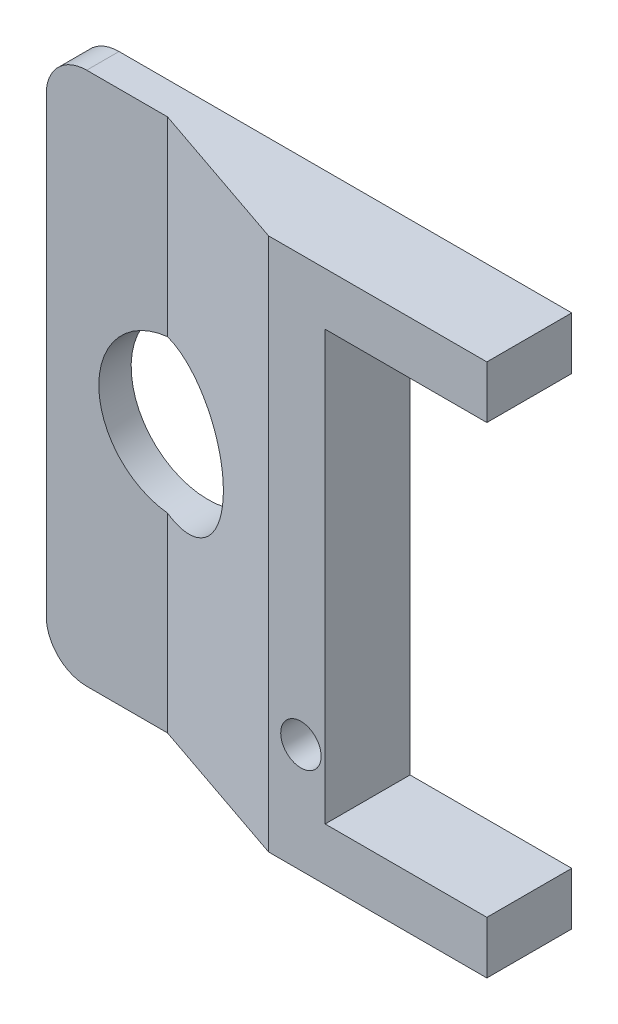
ISO-10303-21;
HEADER;
FILE_DESCRIPTION(('STEP AP214'),'2;1');
FILE_NAME('part.step','',(''),(''),'','','');
FILE_SCHEMA(('AUTOMOTIVE_DESIGN { 1 0 10303 214 1 1 1 1 }'));
ENDSEC;
DATA;
#1=APPLICATION_CONTEXT('core data for automotive mechanical design processes');
#2=APPLICATION_PROTOCOL_DEFINITION('international standard','automotive_design',2000,#1);
#3=PRODUCT_CONTEXT('',#1,'mechanical');
#4=PRODUCT('Part','Part','',(#3));
#5=PRODUCT_RELATED_PRODUCT_CATEGORY('part','',(#4));
#6=PRODUCT_DEFINITION_FORMATION('','',#4);
#7=PRODUCT_DEFINITION_CONTEXT('part definition',#1,'design');
#8=PRODUCT_DEFINITION('design','',#6,#7);
#9=PRODUCT_DEFINITION_SHAPE('','',#8);
#10=(LENGTH_UNIT() NAMED_UNIT(*) SI_UNIT(.MILLI.,.METRE.));
#11=(NAMED_UNIT(*) PLANE_ANGLE_UNIT() SI_UNIT($,.RADIAN.));
#12=(NAMED_UNIT(*) SI_UNIT($,.STERADIAN.) SOLID_ANGLE_UNIT());
#13=UNCERTAINTY_MEASURE_WITH_UNIT(LENGTH_MEASURE(1.E-05),#10,'distance_accuracy_value','');
#14=(GEOMETRIC_REPRESENTATION_CONTEXT(3) GLOBAL_UNCERTAINTY_ASSIGNED_CONTEXT((#13)) GLOBAL_UNIT_ASSIGNED_CONTEXT((#10,
#11,#12)) REPRESENTATION_CONTEXT('',''));
#15=CARTESIAN_POINT('',(0.,0.,0.));
#16=DIRECTION('',(0.,0.,1.));
#17=DIRECTION('',(1.,0.,0.));
#18=AXIS2_PLACEMENT_3D('',#15,#16,#17);
#19=CARTESIAN_POINT('',(45.,-33.,0.));
#20=DIRECTION('',(-1.,0.,0.));
#21=DIRECTION('',(0.,0.,-1.));
#22=AXIS2_PLACEMENT_3D('',#19,#20,#21);
#23=PLANE('',#22);
#24=DIRECTION('',(0.,1.,0.));
#25=VECTOR('',#24,1.);
#26=CARTESIAN_POINT('',(45.,-33.,10.5));
#27=LINE('',#26,#25);
#28=CARTESIAN_POINT('',(45.,26.5,10.5));
#29=VERTEX_POINT('',#28);
#30=CARTESIAN_POINT('',(45.,33.,10.5));
#31=VERTEX_POINT('',#30);
#32=EDGE_CURVE('E134',#29,#31,#27,.T.);
#33=ORIENTED_EDGE('',*,*,#32,.F.);
#34=DIRECTION('',(0.,0.,-1.));
#35=VECTOR('',#34,1.);
#36=CARTESIAN_POINT('',(45.,26.5,10.5));
#37=LINE('',#36,#35);
#38=CARTESIAN_POINT('',(45.,26.5,0.));
#39=VERTEX_POINT('',#38);
#40=EDGE_CURVE('E200',#29,#39,#37,.T.);
#41=ORIENTED_EDGE('',*,*,#40,.T.);
#42=DIRECTION('',(0.,1.,0.));
#43=VECTOR('',#42,1.);
#44=CARTESIAN_POINT('',(45.,-33.,0.));
#45=LINE('',#44,#43);
#46=CARTESIAN_POINT('',(45.,33.,0.));
#47=VERTEX_POINT('',#46);
#48=EDGE_CURVE('E190',#39,#47,#45,.T.);
#49=ORIENTED_EDGE('',*,*,#48,.T.);
#50=DIRECTION('',(0.,0.,1.));
#51=VECTOR('',#50,1.);
#52=CARTESIAN_POINT('',(45.,33.,0.));
#53=LINE('',#52,#51);
#54=EDGE_CURVE('E174',#47,#31,#53,.T.);
#55=ORIENTED_EDGE('',*,*,#54,.T.);
#56=EDGE_LOOP('',(#33,#41,#49,#55));
#57=FACE_BOUND('',#56,.T.);
#58=ADVANCED_FACE('F14',(#57),#23,.F.);
#59=CARTESIAN_POINT('',(45.,-33.,0.));
#60=VERTEX_POINT('',#59);
#61=CARTESIAN_POINT('',(45.,-26.5,0.));
#62=VERTEX_POINT('',#61);
#63=EDGE_CURVE('E191',#60,#62,#45,.T.);
#64=ORIENTED_EDGE('',*,*,#63,.T.);
#65=DIRECTION('',(0.,0.,-1.));
#66=VECTOR('',#65,1.);
#67=CARTESIAN_POINT('',(45.,-26.5,10.5));
#68=LINE('',#67,#66);
#69=CARTESIAN_POINT('',(45.,-26.5,10.5));
#70=VERTEX_POINT('',#69);
#71=EDGE_CURVE('E226',#70,#62,#68,.T.);
#72=ORIENTED_EDGE('',*,*,#71,.F.);
#73=CARTESIAN_POINT('',(45.,-33.,10.5));
#74=VERTEX_POINT('',#73);
#75=EDGE_CURVE('E140',#74,#70,#27,.T.);
#76=ORIENTED_EDGE('',*,*,#75,.F.);
#77=DIRECTION('',(0.,0.,1.));
#78=VECTOR('',#77,1.);
#79=CARTESIAN_POINT('',(45.,-33.,0.));
#80=LINE('',#79,#78);
#81=EDGE_CURVE('E175',#60,#74,#80,.T.);
#82=ORIENTED_EDGE('',*,*,#81,.F.);
#83=EDGE_LOOP('',(#64,#72,#76,#82));
#84=FACE_BOUND('',#83,.T.);
#85=ADVANCED_FACE('F16',(#84),#23,.F.);
#86=CARTESIAN_POINT('',(45.,-33.,10.5));
#87=DIRECTION('',(0.,0.,-1.));
#88=DIRECTION('',(0.,-1.,0.));
#89=AXIS2_PLACEMENT_3D('',#86,#87,#88);
#90=PLANE('',#89);
#91=CARTESIAN_POINT('',(22.,-19.5,10.5));
#92=DIRECTION('',(0.,0.,1.));
#93=DIRECTION('',(0.,1.,0.));
#94=AXIS2_PLACEMENT_3D('',#91,#92,#93);
#95=CIRCLE('',#94,2.5);
#96=CARTESIAN_POINT('',(22.,-17.,10.5));
#97=VERTEX_POINT('',#96);
#98=EDGE_CURVE('E306',#97,#97,#95,.T.);
#99=ORIENTED_EDGE('',*,*,#98,.F.);
#100=EDGE_LOOP('',(#99));
#101=FACE_BOUND('',#100,.T.);
#102=DIRECTION('',(0.,1.,0.));
#103=VECTOR('',#102,1.);
#104=CARTESIAN_POINT('',(25.,26.5,10.5));
#105=LINE('',#104,#103);
#106=CARTESIAN_POINT('',(25.,-26.5,10.5));
#107=VERTEX_POINT('',#106);
#108=CARTESIAN_POINT('',(25.,26.5,10.5));
#109=VERTEX_POINT('',#108);
#110=EDGE_CURVE('E219',#107,#109,#105,.T.);
#111=ORIENTED_EDGE('',*,*,#110,.T.);
#112=DIRECTION('',(1.,0.,0.));
#113=VECTOR('',#112,1.);
#114=CARTESIAN_POINT('',(45.,26.5,10.5));
#115=LINE('',#114,#113);
#116=EDGE_CURVE('E213',#109,#29,#115,.T.);
#117=ORIENTED_EDGE('',*,*,#116,.T.);
#118=ORIENTED_EDGE('',*,*,#32,.T.);
#119=DIRECTION('',(-1.,0.,0.));
#120=VECTOR('',#119,1.);
#121=CARTESIAN_POINT('',(45.,33.,10.5));
#122=LINE('',#121,#120);
#123=CARTESIAN_POINT('',(18.,33.,10.5));
#124=VERTEX_POINT('',#123);
#125=EDGE_CURVE('E230',#31,#124,#122,.T.);
#126=ORIENTED_EDGE('',*,*,#125,.T.);
#127=DIRECTION('',(0.,1.,0.));
#128=VECTOR('',#127,1.);
#129=CARTESIAN_POINT('',(18.,-33.,10.5));
#130=LINE('',#129,#128);
#131=CARTESIAN_POINT('',(18.,-33.,10.5));
#132=VERTEX_POINT('',#131);
#133=EDGE_CURVE('E131',#132,#124,#130,.T.);
#134=ORIENTED_EDGE('',*,*,#133,.F.);
#135=DIRECTION('',(-1.,0.,0.));
#136=VECTOR('',#135,1.);
#137=CARTESIAN_POINT('',(45.,-33.,10.5));
#138=LINE('',#137,#136);
#139=EDGE_CURVE('E178',#74,#132,#138,.T.);
#140=ORIENTED_EDGE('',*,*,#139,.F.);
#141=ORIENTED_EDGE('',*,*,#75,.T.);
#142=DIRECTION('',(-1.,0.,0.));
#143=VECTOR('',#142,1.);
#144=CARTESIAN_POINT('',(25.,-26.5,10.5));
#145=LINE('',#144,#143);
#146=EDGE_CURVE('E216',#70,#107,#145,.T.);
#147=ORIENTED_EDGE('',*,*,#146,.T.);
#148=EDGE_LOOP('',(#111,#117,#118,#126,#134,#140,#141,#147));
#149=FACE_BOUND('',#148,.T.);
#150=ADVANCED_FACE('F234',(#101,#149),#90,.F.);
#151=CARTESIAN_POINT('',(18.,-33.,10.5));
#152=DIRECTION('',(0.323687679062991,0.,-0.946163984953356));
#153=DIRECTION('',(0.946163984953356,0.,0.323687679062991));
#154=AXIS2_PLACEMENT_3D('',#151,#152,#153);
#155=PLANE('',#154);
#156=DIRECTION('',(0.,1.,0.));
#157=VECTOR('',#156,1.);
#158=CARTESIAN_POINT('',(-1.,-33.,4.));
#159=LINE('',#158,#157);
#160=CARTESIAN_POINT('',(-1.,9.44722181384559,4.));
#161=VERTEX_POINT('',#160);
#162=CARTESIAN_POINT('',(-1.,33.,4.));
#163=VERTEX_POINT('',#162);
#164=EDGE_CURVE('E126',#161,#163,#159,.T.);
#165=ORIENTED_EDGE('',*,*,#164,.F.);
#166=CARTESIAN_POINT('',(0.,0.,4.34210526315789));
#167=DIRECTION('',(0.323687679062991,0.,-0.946163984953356));
#168=DIRECTION('',(-0.946163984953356,0.,-0.323687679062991));
#169=AXIS2_PLACEMENT_3D('',#166,#167,#168);
#170=ELLIPSE('',#169,10.0405428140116,9.5);
#171=CARTESIAN_POINT('',(-1.,-9.44722181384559,4.));
#172=VERTEX_POINT('',#171);
#173=EDGE_CURVE('E115',#161,#172,#170,.T.);
#174=ORIENTED_EDGE('',*,*,#173,.T.);
#175=CARTESIAN_POINT('',(-1.,-33.,4.));
#176=VERTEX_POINT('',#175);
#177=EDGE_CURVE('E124',#176,#172,#159,.T.);
#178=ORIENTED_EDGE('',*,*,#177,.F.);
#179=DIRECTION('',(-0.946163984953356,0.,-0.323687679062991));
#180=VECTOR('',#179,1.);
#181=CARTESIAN_POINT('',(18.,-33.,10.5));
#182=LINE('',#181,#180);
#183=EDGE_CURVE('E185',#132,#176,#182,.T.);
#184=ORIENTED_EDGE('',*,*,#183,.F.);
#185=ORIENTED_EDGE('',*,*,#133,.T.);
#186=DIRECTION('',(-0.946163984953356,0.,-0.323687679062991));
#187=VECTOR('',#186,1.);
#188=CARTESIAN_POINT('',(18.,33.,10.5));
#189=LINE('',#188,#187);
#190=EDGE_CURVE('E180',#124,#163,#189,.T.);
#191=ORIENTED_EDGE('',*,*,#190,.T.);
#192=EDGE_LOOP('',(#165,#174,#178,#184,#185,#191));
#193=FACE_BOUND('',#192,.T.);
#194=ADVANCED_FACE('F122',(#193),#155,.F.);
#195=CARTESIAN_POINT('',(-1.,-33.,4.));
#196=DIRECTION('',(0.,0.,-1.));
#197=DIRECTION('',(0.,-1.,0.));
#198=AXIS2_PLACEMENT_3D('',#195,#196,#197);
#199=PLANE('',#198);
#200=DIRECTION('',(-1.,0.,0.));
#201=VECTOR('',#200,1.);
#202=CARTESIAN_POINT('',(-1.,33.,4.));
#203=LINE('',#202,#201);
#204=CARTESIAN_POINT('',(-11.,33.,4.));
#205=VERTEX_POINT('',#204);
#206=EDGE_CURVE('E155',#163,#205,#203,.T.);
#207=ORIENTED_EDGE('',*,*,#206,.T.);
#208=CARTESIAN_POINT('',(-11.,28.,4.));
#209=DIRECTION('',(0.,0.,-1.));
#210=DIRECTION('',(0.,-1.,0.));
#211=AXIS2_PLACEMENT_3D('',#208,#209,#210);
#212=CIRCLE('',#211,5.);
#213=CARTESIAN_POINT('',(-16.,28.,4.));
#214=VERTEX_POINT('',#213);
#215=EDGE_CURVE('E22',#205,#214,#212,.F.);
#216=ORIENTED_EDGE('',*,*,#215,.T.);
#217=DIRECTION('',(0.,1.,0.));
#218=VECTOR('',#217,1.);
#219=CARTESIAN_POINT('',(-16.,-33.,4.));
#220=LINE('',#219,#218);
#221=CARTESIAN_POINT('',(-16.,-28.,4.));
#222=VERTEX_POINT('',#221);
#223=EDGE_CURVE('E136',#222,#214,#220,.T.);
#224=ORIENTED_EDGE('',*,*,#223,.F.);
#225=CARTESIAN_POINT('',(-11.,-28.,4.));
#226=DIRECTION('',(0.,0.,-1.));
#227=DIRECTION('',(0.,-1.,0.));
#228=AXIS2_PLACEMENT_3D('',#225,#226,#227);
#229=CIRCLE('',#228,5.);
#230=CARTESIAN_POINT('',(-11.,-33.,4.));
#231=VERTEX_POINT('',#230);
#232=EDGE_CURVE('E29',#222,#231,#229,.F.);
#233=ORIENTED_EDGE('',*,*,#232,.T.);
#234=DIRECTION('',(-1.,0.,0.));
#235=VECTOR('',#234,1.);
#236=CARTESIAN_POINT('',(-1.,-33.,4.));
#237=LINE('',#236,#235);
#238=EDGE_CURVE('E130',#176,#231,#237,.T.);
#239=ORIENTED_EDGE('',*,*,#238,.F.);
#240=ORIENTED_EDGE('',*,*,#177,.T.);
#241=CARTESIAN_POINT('',(0.,0.,4.));
#242=DIRECTION('',(0.,0.,-1.));
#243=DIRECTION('',(0.,-1.,0.));
#244=AXIS2_PLACEMENT_3D('',#241,#242,#243);
#245=CIRCLE('',#244,9.5);
#246=EDGE_CURVE('E112',#172,#161,#245,.T.);
#247=ORIENTED_EDGE('',*,*,#246,.T.);
#248=ORIENTED_EDGE('',*,*,#164,.T.);
#249=EDGE_LOOP('',(#207,#216,#224,#233,#239,#240,#247,#248));
#250=FACE_BOUND('',#249,.T.);
#251=ADVANCED_FACE('F129',(#250),#199,.F.);
#252=CARTESIAN_POINT('',(-16.,-33.,4.));
#253=DIRECTION('',(1.,0.,0.));
#254=DIRECTION('',(0.,0.,1.));
#255=AXIS2_PLACEMENT_3D('',#252,#253,#254);
#256=PLANE('',#255);
#257=ORIENTED_EDGE('',*,*,#223,.T.);
#258=DIRECTION('',(0.,0.,-1.));
#259=VECTOR('',#258,1.);
#260=CARTESIAN_POINT('',(-16.,28.,4.));
#261=LINE('',#260,#259);
#262=CARTESIAN_POINT('',(-16.,28.,0.));
#263=VERTEX_POINT('',#262);
#264=EDGE_CURVE('E145',#214,#263,#261,.T.);
#265=ORIENTED_EDGE('',*,*,#264,.T.);
#266=DIRECTION('',(0.,1.,0.));
#267=VECTOR('',#266,1.);
#268=CARTESIAN_POINT('',(-16.,-33.,0.));
#269=LINE('',#268,#267);
#270=CARTESIAN_POINT('',(-16.,-28.,0.));
#271=VERTEX_POINT('',#270);
#272=EDGE_CURVE('E163',#271,#263,#269,.T.);
#273=ORIENTED_EDGE('',*,*,#272,.F.);
#274=DIRECTION('',(0.,0.,-1.));
#275=VECTOR('',#274,1.);
#276=CARTESIAN_POINT('',(-16.,-28.,4.));
#277=LINE('',#276,#275);
#278=EDGE_CURVE('E143',#271,#222,#277,.F.);
#279=ORIENTED_EDGE('',*,*,#278,.T.);
#280=EDGE_LOOP('',(#257,#265,#273,#279));
#281=FACE_BOUND('',#280,.T.);
#282=ADVANCED_FACE('F159',(#281),#256,.F.);
#283=CARTESIAN_POINT('',(45.,-33.,0.));
#284=DIRECTION('',(0.,0.,1.));
#285=DIRECTION('',(0.,1.,0.));
#286=AXIS2_PLACEMENT_3D('',#283,#284,#285);
#287=PLANE('',#286);
#288=CARTESIAN_POINT('',(22.,-19.5,0.));
#289=DIRECTION('',(0.,0.,1.));
#290=DIRECTION('',(0.,1.,0.));
#291=AXIS2_PLACEMENT_3D('',#288,#289,#290);
#292=CIRCLE('',#291,2.5);
#293=CARTESIAN_POINT('',(22.,-17.,0.));
#294=VERTEX_POINT('',#293);
#295=EDGE_CURVE('E303',#294,#294,#292,.T.);
#296=ORIENTED_EDGE('',*,*,#295,.T.);
#297=EDGE_LOOP('',(#296));
#298=FACE_BOUND('',#297,.T.);
#299=CARTESIAN_POINT('',(0.,0.,0.));
#300=DIRECTION('',(0.,0.,-1.));
#301=DIRECTION('',(0.,-1.,0.));
#302=AXIS2_PLACEMENT_3D('',#299,#300,#301);
#303=CIRCLE('',#302,9.5);
#304=CARTESIAN_POINT('',(0.,-9.5,0.));
#305=VERTEX_POINT('',#304);
#306=EDGE_CURVE('E118',#305,#305,#303,.T.);
#307=ORIENTED_EDGE('',*,*,#306,.F.);
#308=EDGE_LOOP('',(#307));
#309=FACE_BOUND('',#308,.T.);
#310=ORIENTED_EDGE('',*,*,#272,.T.);
#311=CARTESIAN_POINT('',(-11.,28.,0.));
#312=DIRECTION('',(0.,0.,1.));
#313=DIRECTION('',(0.,1.,0.));
#314=AXIS2_PLACEMENT_3D('',#311,#312,#313);
#315=CIRCLE('',#314,5.);
#316=CARTESIAN_POINT('',(-11.,33.,0.));
#317=VERTEX_POINT('',#316);
#318=EDGE_CURVE('E150',#263,#317,#315,.F.);
#319=ORIENTED_EDGE('',*,*,#318,.T.);
#320=DIRECTION('',(1.,0.,0.));
#321=VECTOR('',#320,1.);
#322=CARTESIAN_POINT('',(45.,33.,0.));
#323=LINE('',#322,#321);
#324=EDGE_CURVE('E168',#317,#47,#323,.T.);
#325=ORIENTED_EDGE('',*,*,#324,.T.);
#326=ORIENTED_EDGE('',*,*,#48,.F.);
#327=DIRECTION('',(1.,0.,0.));
#328=VECTOR('',#327,1.);
#329=CARTESIAN_POINT('',(45.,26.5,0.));
#330=LINE('',#329,#328);
#331=CARTESIAN_POINT('',(25.,26.5,0.));
#332=VERTEX_POINT('',#331);
#333=EDGE_CURVE('E127',#332,#39,#330,.T.);
#334=ORIENTED_EDGE('',*,*,#333,.F.);
#335=DIRECTION('',(0.,1.,0.));
#336=VECTOR('',#335,1.);
#337=CARTESIAN_POINT('',(25.,26.5,0.));
#338=LINE('',#337,#336);
#339=CARTESIAN_POINT('',(25.,-26.5,0.));
#340=VERTEX_POINT('',#339);
#341=EDGE_CURVE('E205',#340,#332,#338,.T.);
#342=ORIENTED_EDGE('',*,*,#341,.F.);
#343=DIRECTION('',(-1.,0.,0.));
#344=VECTOR('',#343,1.);
#345=CARTESIAN_POINT('',(25.,-26.5,0.));
#346=LINE('',#345,#344);
#347=EDGE_CURVE('E207',#62,#340,#346,.T.);
#348=ORIENTED_EDGE('',*,*,#347,.F.);
#349=ORIENTED_EDGE('',*,*,#63,.F.);
#350=DIRECTION('',(1.,0.,0.));
#351=VECTOR('',#350,1.);
#352=CARTESIAN_POINT('',(45.,-33.,0.));
#353=LINE('',#352,#351);
#354=CARTESIAN_POINT('',(-11.,-33.,0.));
#355=VERTEX_POINT('',#354);
#356=EDGE_CURVE('E188',#355,#60,#353,.T.);
#357=ORIENTED_EDGE('',*,*,#356,.F.);
#358=CARTESIAN_POINT('',(-11.,-28.,0.));
#359=DIRECTION('',(0.,0.,1.));
#360=DIRECTION('',(0.,1.,0.));
#361=AXIS2_PLACEMENT_3D('',#358,#359,#360);
#362=CIRCLE('',#361,5.);
#363=EDGE_CURVE('E148',#355,#271,#362,.F.);
#364=ORIENTED_EDGE('',*,*,#363,.T.);
#365=EDGE_LOOP('',(#310,#319,#325,#326,#334,#342,#348,#349,#357,#364));
#366=FACE_BOUND('',#365,.T.);
#367=ADVANCED_FACE('F166',(#298,#309,#366),#287,.F.);
#368=CARTESIAN_POINT('',(45.,-33.,0.));
#369=DIRECTION('',(0.,-1.,0.));
#370=DIRECTION('',(0.,0.,1.));
#371=AXIS2_PLACEMENT_3D('',#368,#369,#370);
#372=PLANE('',#371);
#373=ORIENTED_EDGE('',*,*,#238,.T.);
#374=DIRECTION('',(0.,0.,-1.));
#375=VECTOR('',#374,1.);
#376=CARTESIAN_POINT('',(-11.,-33.,0.));
#377=LINE('',#376,#375);
#378=EDGE_CURVE('E9',#231,#355,#377,.T.);
#379=ORIENTED_EDGE('',*,*,#378,.T.);
#380=ORIENTED_EDGE('',*,*,#356,.T.);
#381=ORIENTED_EDGE('',*,*,#81,.T.);
#382=ORIENTED_EDGE('',*,*,#139,.T.);
#383=ORIENTED_EDGE('',*,*,#183,.T.);
#384=EDGE_LOOP('',(#373,#379,#380,#381,#382,#383));
#385=FACE_BOUND('',#384,.T.);
#386=ADVANCED_FACE('F245',(#385),#372,.T.);
#387=CARTESIAN_POINT('',(45.,33.,0.));
#388=DIRECTION('',(0.,-1.,0.));
#389=DIRECTION('',(0.,0.,1.));
#390=AXIS2_PLACEMENT_3D('',#387,#388,#389);
#391=PLANE('',#390);
#392=ORIENTED_EDGE('',*,*,#324,.F.);
#393=DIRECTION('',(0.,0.,-1.));
#394=VECTOR('',#393,1.);
#395=CARTESIAN_POINT('',(-11.,33.,0.));
#396=LINE('',#395,#394);
#397=EDGE_CURVE('E37',#317,#205,#396,.F.);
#398=ORIENTED_EDGE('',*,*,#397,.T.);
#399=ORIENTED_EDGE('',*,*,#206,.F.);
#400=ORIENTED_EDGE('',*,*,#190,.F.);
#401=ORIENTED_EDGE('',*,*,#125,.F.);
#402=ORIENTED_EDGE('',*,*,#54,.F.);
#403=EDGE_LOOP('',(#392,#398,#399,#400,#401,#402));
#404=FACE_BOUND('',#403,.T.);
#405=ADVANCED_FACE('F171',(#404),#391,.F.);
#406=CARTESIAN_POINT('',(45.,26.5,10.5));
#407=DIRECTION('',(0.,1.,0.));
#408=DIRECTION('',(1.,0.,0.));
#409=AXIS2_PLACEMENT_3D('',#406,#407,#408);
#410=PLANE('',#409);
#411=ORIENTED_EDGE('',*,*,#333,.T.);
#412=ORIENTED_EDGE('',*,*,#40,.F.);
#413=ORIENTED_EDGE('',*,*,#116,.F.);
#414=DIRECTION('',(0.,0.,-1.));
#415=VECTOR('',#414,1.);
#416=CARTESIAN_POINT('',(25.,26.5,10.5));
#417=LINE('',#416,#415);
#418=EDGE_CURVE('E222',#109,#332,#417,.T.);
#419=ORIENTED_EDGE('',*,*,#418,.T.);
#420=EDGE_LOOP('',(#411,#412,#413,#419));
#421=FACE_BOUND('',#420,.T.);
#422=ADVANCED_FACE('F237',(#421),#410,.F.);
#423=CARTESIAN_POINT('',(25.,26.5,10.5));
#424=DIRECTION('',(-1.,0.,0.));
#425=DIRECTION('',(0.,0.,-1.));
#426=AXIS2_PLACEMENT_3D('',#423,#424,#425);
#427=PLANE('',#426);
#428=ORIENTED_EDGE('',*,*,#341,.T.);
#429=ORIENTED_EDGE('',*,*,#418,.F.);
#430=ORIENTED_EDGE('',*,*,#110,.F.);
#431=DIRECTION('',(0.,0.,-1.));
#432=VECTOR('',#431,1.);
#433=CARTESIAN_POINT('',(25.,-26.5,10.5));
#434=LINE('',#433,#432);
#435=EDGE_CURVE('E224',#107,#340,#434,.T.);
#436=ORIENTED_EDGE('',*,*,#435,.T.);
#437=EDGE_LOOP('',(#428,#429,#430,#436));
#438=FACE_BOUND('',#437,.T.);
#439=ADVANCED_FACE('F239',(#438),#427,.F.);
#440=CARTESIAN_POINT('',(25.,-26.5,10.5));
#441=DIRECTION('',(0.,-1.,0.));
#442=DIRECTION('',(-1.,0.,0.));
#443=AXIS2_PLACEMENT_3D('',#440,#441,#442);
#444=PLANE('',#443);
#445=ORIENTED_EDGE('',*,*,#347,.T.);
#446=ORIENTED_EDGE('',*,*,#435,.F.);
#447=ORIENTED_EDGE('',*,*,#146,.F.);
#448=ORIENTED_EDGE('',*,*,#71,.T.);
#449=EDGE_LOOP('',(#445,#446,#447,#448));
#450=FACE_BOUND('',#449,.T.);
#451=ADVANCED_FACE('F241',(#450),#444,.F.);
#452=CARTESIAN_POINT('',(0.,0.,10.5));
#453=DIRECTION('',(0.,0.,-1.));
#454=DIRECTION('',(0.,-1.,0.));
#455=AXIS2_PLACEMENT_3D('',#452,#453,#454);
#456=CYLINDRICAL_SURFACE('',#455,9.5);
#457=ORIENTED_EDGE('',*,*,#306,.T.);
#458=EDGE_LOOP('',(#457));
#459=FACE_BOUND('',#458,.T.);
#460=ORIENTED_EDGE('',*,*,#246,.F.);
#461=ORIENTED_EDGE('',*,*,#173,.F.);
#462=EDGE_LOOP('',(#460,#461));
#463=FACE_BOUND('',#462,.T.);
#464=ADVANCED_FACE('F114',(#459,#463),#456,.F.);
#465=CARTESIAN_POINT('',(-11.,28.,4.));
#466=DIRECTION('',(0.,0.,-1.));
#467=DIRECTION('',(0.,-1.,0.));
#468=AXIS2_PLACEMENT_3D('',#465,#466,#467);
#469=CYLINDRICAL_SURFACE('',#468,5.);
#470=ORIENTED_EDGE('',*,*,#215,.F.);
#471=ORIENTED_EDGE('',*,*,#397,.F.);
#472=ORIENTED_EDGE('',*,*,#318,.F.);
#473=ORIENTED_EDGE('',*,*,#264,.F.);
#474=EDGE_LOOP('',(#470,#471,#472,#473));
#475=FACE_BOUND('',#474,.T.);
#476=ADVANCED_FACE('F164',(#475),#469,.T.);
#477=CARTESIAN_POINT('',(-11.,-28.,0.));
#478=DIRECTION('',(0.,0.,1.));
#479=DIRECTION('',(0.,1.,0.));
#480=AXIS2_PLACEMENT_3D('',#477,#478,#479);
#481=CYLINDRICAL_SURFACE('',#480,5.);
#482=ORIENTED_EDGE('',*,*,#232,.F.);
#483=ORIENTED_EDGE('',*,*,#278,.F.);
#484=ORIENTED_EDGE('',*,*,#363,.F.);
#485=ORIENTED_EDGE('',*,*,#378,.F.);
#486=EDGE_LOOP('',(#482,#483,#484,#485));
#487=FACE_BOUND('',#486,.T.);
#488=ADVANCED_FACE('F248',(#487),#481,.T.);
#489=CARTESIAN_POINT('',(22.,-19.5,0.));
#490=DIRECTION('',(0.,0.,1.));
#491=DIRECTION('',(0.,1.,0.));
#492=AXIS2_PLACEMENT_3D('',#489,#490,#491);
#493=CYLINDRICAL_SURFACE('',#492,2.5);
#494=ORIENTED_EDGE('',*,*,#295,.F.);
#495=EDGE_LOOP('',(#494));
#496=FACE_BOUND('',#495,.T.);
#497=ORIENTED_EDGE('',*,*,#98,.T.);
#498=EDGE_LOOP('',(#497));
#499=FACE_BOUND('',#498,.T.);
#500=ADVANCED_FACE('F250',(#496,#499),#493,.F.);
#501=CLOSED_SHELL('',(#58,#85,#150,#194,#251,#282,#367,#386,#405,#422,#439,#451,#464,#476,#488,#500));
#502=MANIFOLD_SOLID_BREP('B1',#501);
#503=ADVANCED_BREP_SHAPE_REPRESENTATION('',(#18,#502),#14);
#504=SHAPE_DEFINITION_REPRESENTATION(#9,#503);
ENDSEC;
END-ISO-10303-21;
